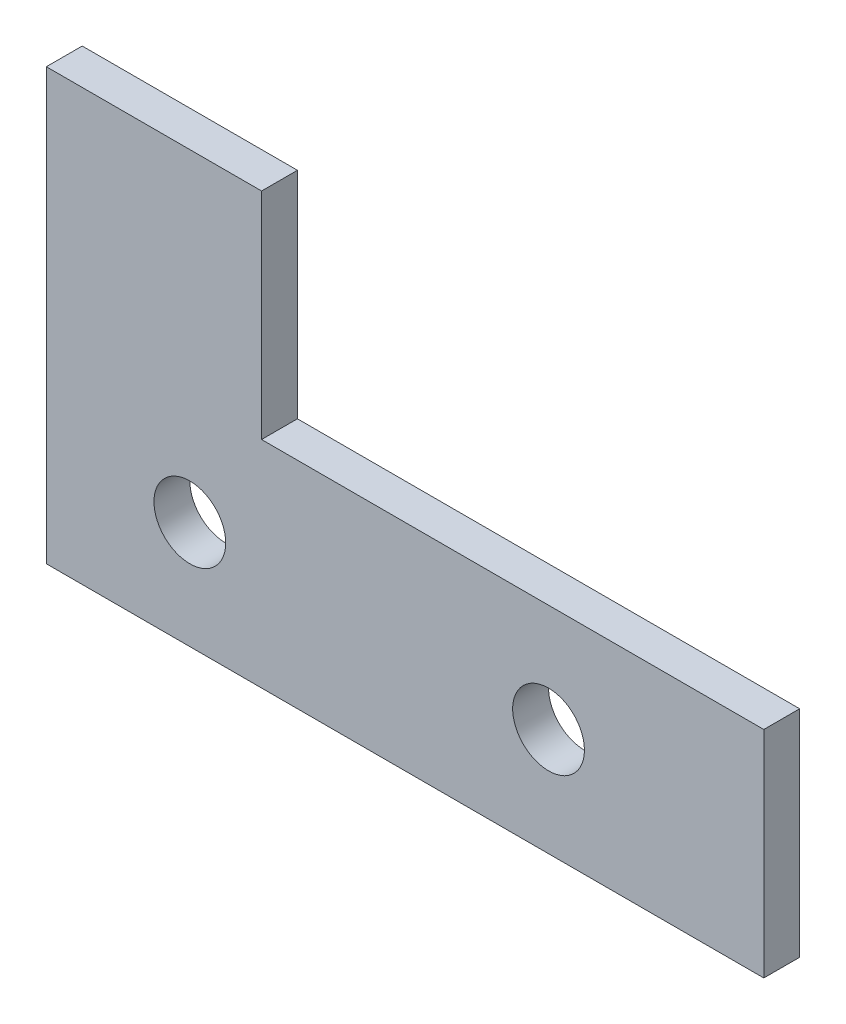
from build123d import *

# Parameters (mm, degrees)
SKETCH1_R          = 6.35
BASE_EXTRUDE_DEPTH = 6.35


with BuildPart() as part:
    # Sketch1 → Base-Extrude (new body)
    with BuildSketch(Plane.XY):
        Polygon((38.1, 38.1), (127, 38.1), (127, 0), (0, 0), (0, 76.2), (38.1, 76.2), align=None)
        with Locations((25.4, 19.05)):
            Circle(SKETCH1_R, mode=Mode.SUBTRACT)
        with Locations((88.9, 19.05)):
            Circle(SKETCH1_R, mode=Mode.SUBTRACT)
    extrude(amount=BASE_EXTRUDE_DEPTH)


solid = part.part
